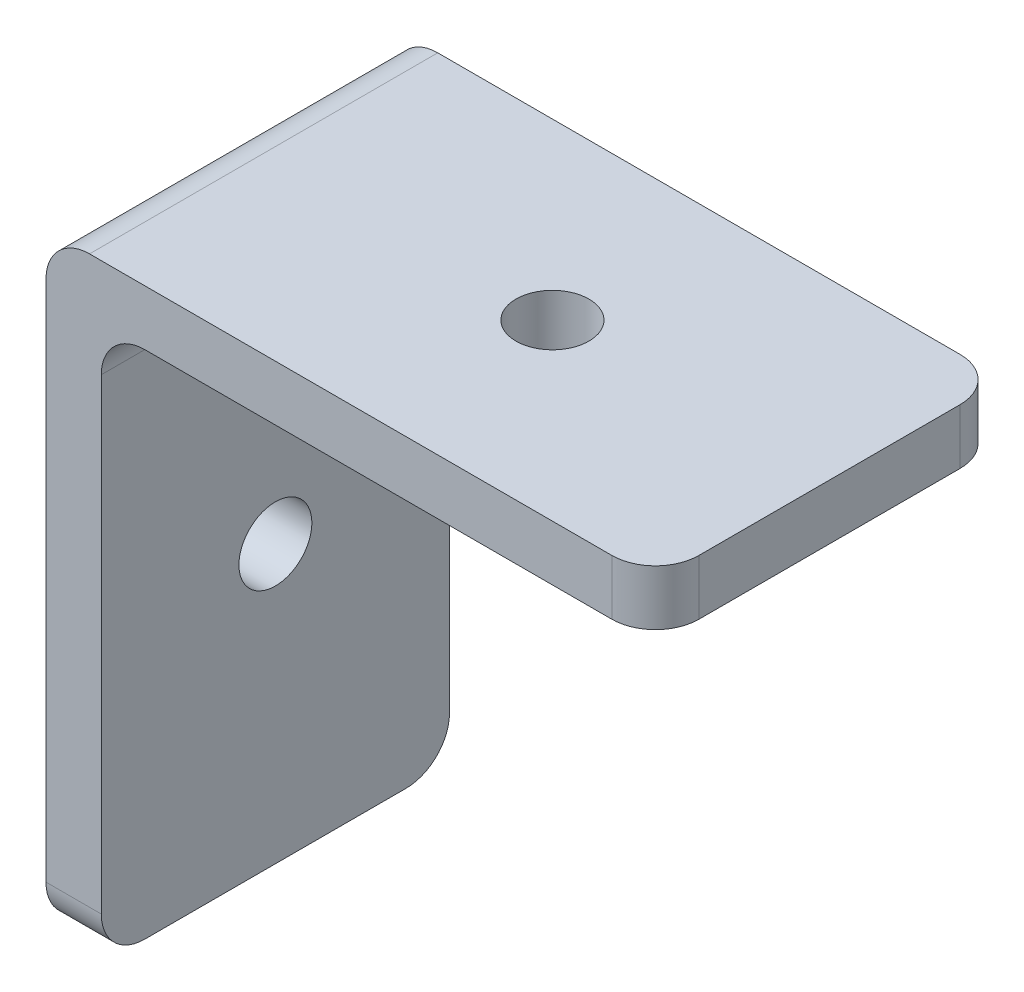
ISO-10303-21;
HEADER;
FILE_DESCRIPTION(('STEP AP214'),'2;1');
FILE_NAME('part.step','',(''),(''),'','','');
FILE_SCHEMA(('AUTOMOTIVE_DESIGN { 1 0 10303 214 1 1 1 1 }'));
ENDSEC;
DATA;
#1=APPLICATION_CONTEXT('core data for automotive mechanical design processes');
#2=APPLICATION_PROTOCOL_DEFINITION('international standard','automotive_design',2000,#1);
#3=PRODUCT_CONTEXT('',#1,'mechanical');
#4=PRODUCT('Part','Part','',(#3));
#5=PRODUCT_RELATED_PRODUCT_CATEGORY('part','',(#4));
#6=PRODUCT_DEFINITION_FORMATION('','',#4);
#7=PRODUCT_DEFINITION_CONTEXT('part definition',#1,'design');
#8=PRODUCT_DEFINITION('design','',#6,#7);
#9=PRODUCT_DEFINITION_SHAPE('','',#8);
#10=(LENGTH_UNIT() NAMED_UNIT(*) SI_UNIT(.MILLI.,.METRE.));
#11=(NAMED_UNIT(*) PLANE_ANGLE_UNIT() SI_UNIT($,.RADIAN.));
#12=(NAMED_UNIT(*) SI_UNIT($,.STERADIAN.) SOLID_ANGLE_UNIT());
#13=UNCERTAINTY_MEASURE_WITH_UNIT(LENGTH_MEASURE(1.E-05),#10,'distance_accuracy_value','');
#14=(GEOMETRIC_REPRESENTATION_CONTEXT(3) GLOBAL_UNCERTAINTY_ASSIGNED_CONTEXT((#13)) GLOBAL_UNIT_ASSIGNED_CONTEXT((#10,
#11,#12)) REPRESENTATION_CONTEXT('',''));
#15=CARTESIAN_POINT('',(0.,0.,0.));
#16=DIRECTION('',(0.,0.,1.));
#17=DIRECTION('',(1.,0.,0.));
#18=AXIS2_PLACEMENT_3D('',#15,#16,#17);
#19=CARTESIAN_POINT('',(0.,0.,0.));
#20=DIRECTION('',(0.,0.,1.));
#21=DIRECTION('',(1.,0.,0.));
#22=AXIS2_PLACEMENT_3D('',#19,#20,#21);
#23=PLANE('',#22);
#24=DIRECTION('',(0.,-1.,0.));
#25=VECTOR('',#24,1.);
#26=CARTESIAN_POINT('',(9.99999999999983,0.,0.));
#27=LINE('',#26,#25);
#28=CARTESIAN_POINT('',(9.99999999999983,212.5,0.));
#29=VERTEX_POINT('',#28);
#30=CARTESIAN_POINT('',(9.99999999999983,182.5,0.));
#31=VERTEX_POINT('',#30);
#32=EDGE_CURVE('E235',#29,#31,#27,.T.);
#33=ORIENTED_EDGE('',*,*,#32,.T.);
#34=DIRECTION('',(-1.,0.,0.));
#35=VECTOR('',#34,1.);
#36=CARTESIAN_POINT('',(13.1749999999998,182.5,0.));
#37=LINE('',#36,#35);
#38=CARTESIAN_POINT('',(13.1749999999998,182.5,0.));
#39=VERTEX_POINT('',#38);
#40=EDGE_CURVE('E182',#31,#39,#37,.F.);
#41=ORIENTED_EDGE('',*,*,#40,.T.);
#42=DIRECTION('',(0.,-1.,0.));
#43=VECTOR('',#42,1.);
#44=CARTESIAN_POINT('',(13.1749999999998,0.,0.));
#45=LINE('',#44,#43);
#46=CARTESIAN_POINT('',(13.1749999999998,209.325,0.));
#47=VERTEX_POINT('',#46);
#48=EDGE_CURVE('E206',#47,#39,#45,.T.);
#49=ORIENTED_EDGE('',*,*,#48,.F.);
#50=CARTESIAN_POINT('',(15.6749999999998,209.325,0.));
#51=DIRECTION('',(0.,0.,1.));
#52=DIRECTION('',(1.,0.,0.));
#53=AXIS2_PLACEMENT_3D('',#50,#51,#52);
#54=CIRCLE('',#53,2.5);
#55=CARTESIAN_POINT('',(15.6749999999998,211.825,0.));
#56=VERTEX_POINT('',#55);
#57=EDGE_CURVE('E49',#47,#56,#54,.F.);
#58=ORIENTED_EDGE('',*,*,#57,.T.);
#59=DIRECTION('',(-1.,0.,0.));
#60=VECTOR('',#59,1.);
#61=CARTESIAN_POINT('',(0.,211.825,0.));
#62=LINE('',#61,#60);
#63=CARTESIAN_POINT('',(42.4999999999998,211.825,0.));
#64=VERTEX_POINT('',#63);
#65=EDGE_CURVE('E203',#64,#56,#62,.T.);
#66=ORIENTED_EDGE('',*,*,#65,.F.);
#67=DIRECTION('',(0.,1.,0.));
#68=VECTOR('',#67,1.);
#69=CARTESIAN_POINT('',(42.4999999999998,0.,0.));
#70=LINE('',#69,#68);
#71=CARTESIAN_POINT('',(42.4999999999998,215.,0.));
#72=VERTEX_POINT('',#71);
#73=EDGE_CURVE('E179',#64,#72,#70,.T.);
#74=ORIENTED_EDGE('',*,*,#73,.T.);
#75=DIRECTION('',(-1.,0.,0.));
#76=VECTOR('',#75,1.);
#77=CARTESIAN_POINT('',(0.,215.,0.));
#78=LINE('',#77,#76);
#79=CARTESIAN_POINT('',(12.4999999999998,215.,0.));
#80=VERTEX_POINT('',#79);
#81=EDGE_CURVE('E216',#72,#80,#78,.T.);
#82=ORIENTED_EDGE('',*,*,#81,.T.);
#83=CARTESIAN_POINT('',(12.4999999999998,212.5,0.));
#84=DIRECTION('',(0.,0.,1.));
#85=DIRECTION('',(1.,0.,0.));
#86=AXIS2_PLACEMENT_3D('',#83,#84,#85);
#87=CIRCLE('',#86,2.5);
#88=EDGE_CURVE('E140',#80,#29,#87,.T.);
#89=ORIENTED_EDGE('',*,*,#88,.T.);
#90=EDGE_LOOP('',(#33,#41,#49,#58,#66,#74,#82,#89));
#91=FACE_BOUND('',#90,.T.);
#92=ADVANCED_FACE('F41',(#91),#23,.T.);
#93=CARTESIAN_POINT('',(0.,211.825,-69.4974746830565));
#94=DIRECTION('',(0.,1.,0.));
#95=DIRECTION('',(0.,0.,1.));
#96=AXIS2_PLACEMENT_3D('',#93,#94,#95);
#97=PLANE('',#96);
#98=CARTESIAN_POINT('',(29.0874999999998,211.825,-9.9999999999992));
#99=DIRECTION('',(0.,1.,0.));
#100=DIRECTION('',(-1.,0.,0.));
#101=AXIS2_PLACEMENT_3D('',#98,#99,#100);
#102=CIRCLE('',#101,2.09500000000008);
#103=CARTESIAN_POINT('',(26.9924999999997,211.825,-9.9999999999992));
#104=VERTEX_POINT('',#103);
#105=EDGE_CURVE('E250',#104,#104,#102,.T.);
#106=ORIENTED_EDGE('',*,*,#105,.T.);
#107=EDGE_LOOP('',(#106));
#108=FACE_BOUND('',#107,.T.);
#109=DIRECTION('',(1.,0.,0.));
#110=VECTOR('',#109,1.);
#111=CARTESIAN_POINT('',(-6.79627503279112E-13,211.825,-19.9999999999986));
#112=LINE('',#111,#110);
#113=CARTESIAN_POINT('',(15.6749999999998,211.825,-19.9999999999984));
#114=VERTEX_POINT('',#113);
#115=CARTESIAN_POINT('',(42.4999999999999,211.825,-19.999999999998));
#116=VERTEX_POINT('',#115);
#117=EDGE_CURVE('E223',#114,#116,#112,.T.);
#118=ORIENTED_EDGE('',*,*,#117,.T.);
#119=CARTESIAN_POINT('',(42.4999999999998,211.825,-17.499999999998));
#120=DIRECTION('',(0.,1.,0.));
#121=DIRECTION('',(0.,0.,1.));
#122=AXIS2_PLACEMENT_3D('',#119,#120,#121);
#123=CIRCLE('',#122,2.5);
#124=CARTESIAN_POINT('',(44.9999999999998,211.825,-17.499999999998));
#125=VERTEX_POINT('',#124);
#126=EDGE_CURVE('E188',#116,#125,#123,.F.);
#127=ORIENTED_EDGE('',*,*,#126,.T.);
#128=DIRECTION('',(0.,0.,1.));
#129=VECTOR('',#128,1.);
#130=CARTESIAN_POINT('',(44.9999999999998,211.825,-69.4974746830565));
#131=LINE('',#130,#129);
#132=CARTESIAN_POINT('',(44.9999999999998,211.825,-2.5));
#133=VERTEX_POINT('',#132);
#134=EDGE_CURVE('E237',#125,#133,#131,.T.);
#135=ORIENTED_EDGE('',*,*,#134,.T.);
#136=CARTESIAN_POINT('',(42.4999999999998,211.825,-2.5));
#137=DIRECTION('',(0.,1.,0.));
#138=DIRECTION('',(0.,0.,1.));
#139=AXIS2_PLACEMENT_3D('',#136,#137,#138);
#140=CIRCLE('',#139,2.5);
#141=EDGE_CURVE('E186',#133,#64,#140,.F.);
#142=ORIENTED_EDGE('',*,*,#141,.T.);
#143=ORIENTED_EDGE('',*,*,#65,.T.);
#144=DIRECTION('',(0.,0.,1.));
#145=VECTOR('',#144,1.);
#146=CARTESIAN_POINT('',(15.6749999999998,211.825,-19.9999999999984));
#147=LINE('',#146,#145);
#148=EDGE_CURVE('E184',#56,#114,#147,.F.);
#149=ORIENTED_EDGE('',*,*,#148,.T.);
#150=EDGE_LOOP('',(#118,#127,#135,#142,#143,#149));
#151=FACE_BOUND('',#150,.T.);
#152=ADVANCED_FACE('F212',(#108,#151),#97,.F.);
#153=CARTESIAN_POINT('',(44.9999999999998,0.,-69.4974746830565));
#154=DIRECTION('',(1.,0.,0.));
#155=DIRECTION('',(0.,0.,-1.));
#156=AXIS2_PLACEMENT_3D('',#153,#154,#155);
#157=PLANE('',#156);
#158=ORIENTED_EDGE('',*,*,#134,.F.);
#159=DIRECTION('',(0.,-1.,0.));
#160=VECTOR('',#159,1.);
#161=CARTESIAN_POINT('',(44.9999999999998,215.,-17.499999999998));
#162=LINE('',#161,#160);
#163=CARTESIAN_POINT('',(44.9999999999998,215.,-17.499999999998));
#164=VERTEX_POINT('',#163);
#165=EDGE_CURVE('E63',#125,#164,#162,.F.);
#166=ORIENTED_EDGE('',*,*,#165,.T.);
#167=DIRECTION('',(0.,0.,1.));
#168=VECTOR('',#167,1.);
#169=CARTESIAN_POINT('',(44.9999999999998,215.,-69.4974746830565));
#170=LINE('',#169,#168);
#171=CARTESIAN_POINT('',(44.9999999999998,215.,-2.5));
#172=VERTEX_POINT('',#171);
#173=EDGE_CURVE('E153',#164,#172,#170,.T.);
#174=ORIENTED_EDGE('',*,*,#173,.T.);
#175=DIRECTION('',(0.,1.,0.));
#176=VECTOR('',#175,1.);
#177=CARTESIAN_POINT('',(44.9999999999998,0.,-2.5));
#178=LINE('',#177,#176);
#179=EDGE_CURVE('E190',#172,#133,#178,.F.);
#180=ORIENTED_EDGE('',*,*,#179,.T.);
#181=EDGE_LOOP('',(#158,#166,#174,#180));
#182=FACE_BOUND('',#181,.T.);
#183=ADVANCED_FACE('F261',(#182),#157,.T.);
#184=CARTESIAN_POINT('',(0.,215.,-69.4974746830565));
#185=DIRECTION('',(0.,1.,0.));
#186=DIRECTION('',(0.,0.,1.));
#187=AXIS2_PLACEMENT_3D('',#184,#185,#186);
#188=PLANE('',#187);
#189=CARTESIAN_POINT('',(29.0874999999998,215.,-9.9999999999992));
#190=DIRECTION('',(0.,1.,0.));
#191=DIRECTION('',(-1.,0.,0.));
#192=AXIS2_PLACEMENT_3D('',#189,#190,#191);
#193=CIRCLE('',#192,2.09500000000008);
#194=CARTESIAN_POINT('',(26.9924999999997,215.,-9.9999999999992));
#195=VERTEX_POINT('',#194);
#196=EDGE_CURVE('E247',#195,#195,#193,.T.);
#197=ORIENTED_EDGE('',*,*,#196,.F.);
#198=EDGE_LOOP('',(#197));
#199=FACE_BOUND('',#198,.T.);
#200=ORIENTED_EDGE('',*,*,#173,.F.);
#201=CARTESIAN_POINT('',(42.4999999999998,215.,-17.499999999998));
#202=DIRECTION('',(0.,1.,0.));
#203=DIRECTION('',(0.,0.,1.));
#204=AXIS2_PLACEMENT_3D('',#201,#202,#203);
#205=CIRCLE('',#204,2.5);
#206=CARTESIAN_POINT('',(42.4999999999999,215.,-19.999999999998));
#207=VERTEX_POINT('',#206);
#208=EDGE_CURVE('E197',#164,#207,#205,.T.);
#209=ORIENTED_EDGE('',*,*,#208,.T.);
#210=DIRECTION('',(1.,0.,0.));
#211=VECTOR('',#210,1.);
#212=CARTESIAN_POINT('',(-6.79627503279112E-13,215.,-19.9999999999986));
#213=LINE('',#212,#211);
#214=CARTESIAN_POINT('',(12.4999999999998,215.,-19.9999999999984));
#215=VERTEX_POINT('',#214);
#216=EDGE_CURVE('E227',#215,#207,#213,.T.);
#217=ORIENTED_EDGE('',*,*,#216,.F.);
#218=DIRECTION('',(0.,0.,1.));
#219=VECTOR('',#218,1.);
#220=CARTESIAN_POINT('',(12.4999999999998,215.,-69.4974746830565));
#221=LINE('',#220,#219);
#222=EDGE_CURVE('E193',#215,#80,#221,.T.);
#223=ORIENTED_EDGE('',*,*,#222,.T.);
#224=ORIENTED_EDGE('',*,*,#81,.F.);
#225=CARTESIAN_POINT('',(42.4999999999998,215.,-2.5));
#226=DIRECTION('',(0.,1.,0.));
#227=DIRECTION('',(0.,0.,1.));
#228=AXIS2_PLACEMENT_3D('',#225,#226,#227);
#229=CIRCLE('',#228,2.5);
#230=EDGE_CURVE('E56',#72,#172,#229,.T.);
#231=ORIENTED_EDGE('',*,*,#230,.T.);
#232=EDGE_LOOP('',(#200,#209,#217,#223,#224,#231));
#233=FACE_BOUND('',#232,.T.);
#234=ADVANCED_FACE('F259',(#199,#233),#188,.T.);
#235=CARTESIAN_POINT('',(9.99999999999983,0.,-69.4974746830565));
#236=DIRECTION('',(-1.,0.,0.));
#237=DIRECTION('',(0.,0.,1.));
#238=AXIS2_PLACEMENT_3D('',#235,#236,#237);
#239=PLANE('',#238);
#240=CARTESIAN_POINT('',(9.99999999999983,195.9125,-9.9999999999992));
#241=DIRECTION('',(1.,0.,0.));
#242=DIRECTION('',(0.,1.,0.));
#243=AXIS2_PLACEMENT_3D('',#240,#241,#242);
#244=CIRCLE('',#243,2.09500000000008);
#245=CARTESIAN_POINT('',(9.99999999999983,198.0075,-9.9999999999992));
#246=VERTEX_POINT('',#245);
#247=EDGE_CURVE('E231',#246,#246,#244,.T.);
#248=ORIENTED_EDGE('',*,*,#247,.T.);
#249=EDGE_LOOP('',(#248));
#250=FACE_BOUND('',#249,.T.);
#251=DIRECTION('',(0.,1.,0.));
#252=VECTOR('',#251,1.);
#253=CARTESIAN_POINT('',(9.99999999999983,1.61168975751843E-13,-19.9999999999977));
#254=LINE('',#253,#252);
#255=CARTESIAN_POINT('',(9.99999999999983,182.5,-19.9999999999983));
#256=VERTEX_POINT('',#255);
#257=CARTESIAN_POINT('',(9.99999999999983,212.5,-19.9999999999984));
#258=VERTEX_POINT('',#257);
#259=EDGE_CURVE('E136',#256,#258,#254,.T.);
#260=ORIENTED_EDGE('',*,*,#259,.F.);
#261=CARTESIAN_POINT('',(9.99999999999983,182.5,-17.4999999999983));
#262=DIRECTION('',(-1.,0.,0.));
#263=DIRECTION('',(0.,0.,1.));
#264=AXIS2_PLACEMENT_3D('',#261,#262,#263);
#265=CIRCLE('',#264,2.5);
#266=CARTESIAN_POINT('',(9.99999999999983,180.,-17.4999999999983));
#267=VERTEX_POINT('',#266);
#268=EDGE_CURVE('E131',#256,#267,#265,.T.);
#269=ORIENTED_EDGE('',*,*,#268,.T.);
#270=DIRECTION('',(0.,0.,1.));
#271=VECTOR('',#270,1.);
#272=CARTESIAN_POINT('',(9.99999999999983,180.,-69.4974746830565));
#273=LINE('',#272,#271);
#274=CARTESIAN_POINT('',(9.99999999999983,180.,-2.5));
#275=VERTEX_POINT('',#274);
#276=EDGE_CURVE('E134',#267,#275,#273,.T.);
#277=ORIENTED_EDGE('',*,*,#276,.T.);
#278=CARTESIAN_POINT('',(9.99999999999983,182.5,-2.5));
#279=DIRECTION('',(-1.,0.,0.));
#280=DIRECTION('',(0.,0.,1.));
#281=AXIS2_PLACEMENT_3D('',#278,#279,#280);
#282=CIRCLE('',#281,2.5);
#283=EDGE_CURVE('E141',#275,#31,#282,.T.);
#284=ORIENTED_EDGE('',*,*,#283,.T.);
#285=ORIENTED_EDGE('',*,*,#32,.F.);
#286=DIRECTION('',(0.,0.,1.));
#287=VECTOR('',#286,1.);
#288=CARTESIAN_POINT('',(9.99999999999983,212.5,-69.4974746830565));
#289=LINE('',#288,#287);
#290=EDGE_CURVE('E175',#29,#258,#289,.F.);
#291=ORIENTED_EDGE('',*,*,#290,.T.);
#292=EDGE_LOOP('',(#260,#269,#277,#284,#285,#291));
#293=FACE_BOUND('',#292,.T.);
#294=ADVANCED_FACE('F133',(#250,#293),#239,.T.);
#295=CARTESIAN_POINT('',(0.,180.,-69.4974746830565));
#296=DIRECTION('',(0.,1.,0.));
#297=DIRECTION('',(0.,0.,1.));
#298=AXIS2_PLACEMENT_3D('',#295,#296,#297);
#299=PLANE('',#298);
#300=ORIENTED_EDGE('',*,*,#276,.F.);
#301=DIRECTION('',(1.,0.,0.));
#302=VECTOR('',#301,1.);
#303=CARTESIAN_POINT('',(-7.13953875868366E-13,180.,-17.4999999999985));
#304=LINE('',#303,#302);
#305=CARTESIAN_POINT('',(13.1749999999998,180.,-17.4999999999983));
#306=VERTEX_POINT('',#305);
#307=EDGE_CURVE('E148',#267,#306,#304,.T.);
#308=ORIENTED_EDGE('',*,*,#307,.T.);
#309=DIRECTION('',(0.,0.,1.));
#310=VECTOR('',#309,1.);
#311=CARTESIAN_POINT('',(13.1749999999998,180.,-69.4974746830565));
#312=LINE('',#311,#310);
#313=CARTESIAN_POINT('',(13.1749999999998,180.,-2.5));
#314=VERTEX_POINT('',#313);
#315=EDGE_CURVE('E152',#306,#314,#312,.T.);
#316=ORIENTED_EDGE('',*,*,#315,.T.);
#317=DIRECTION('',(-1.,0.,0.));
#318=VECTOR('',#317,1.);
#319=CARTESIAN_POINT('',(9.99999999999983,180.,-2.5));
#320=LINE('',#319,#318);
#321=EDGE_CURVE('E151',#314,#275,#320,.T.);
#322=ORIENTED_EDGE('',*,*,#321,.T.);
#323=EDGE_LOOP('',(#300,#308,#316,#322));
#324=FACE_BOUND('',#323,.T.);
#325=ADVANCED_FACE('F146',(#324),#299,.F.);
#326=CARTESIAN_POINT('',(13.1749999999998,0.,-69.4974746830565));
#327=DIRECTION('',(-1.,0.,0.));
#328=DIRECTION('',(0.,0.,1.));
#329=AXIS2_PLACEMENT_3D('',#326,#327,#328);
#330=PLANE('',#329);
#331=CARTESIAN_POINT('',(13.1749999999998,195.9125,-9.9999999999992));
#332=DIRECTION('',(1.,0.,0.));
#333=DIRECTION('',(0.,1.,0.));
#334=AXIS2_PLACEMENT_3D('',#331,#332,#333);
#335=CIRCLE('',#334,2.09500000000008);
#336=CARTESIAN_POINT('',(13.1749999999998,198.0075,-9.9999999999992));
#337=VERTEX_POINT('',#336);
#338=EDGE_CURVE('E244',#337,#337,#335,.T.);
#339=ORIENTED_EDGE('',*,*,#338,.F.);
#340=EDGE_LOOP('',(#339));
#341=FACE_BOUND('',#340,.T.);
#342=ORIENTED_EDGE('',*,*,#315,.F.);
#343=CARTESIAN_POINT('',(13.1749999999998,182.5,-17.4999999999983));
#344=DIRECTION('',(-1.,0.,0.));
#345=DIRECTION('',(0.,0.,1.));
#346=AXIS2_PLACEMENT_3D('',#343,#344,#345);
#347=CIRCLE('',#346,2.5);
#348=CARTESIAN_POINT('',(13.1749999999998,182.5,-19.9999999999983));
#349=VERTEX_POINT('',#348);
#350=EDGE_CURVE('E156',#306,#349,#347,.F.);
#351=ORIENTED_EDGE('',*,*,#350,.T.);
#352=DIRECTION('',(0.,1.,0.));
#353=VECTOR('',#352,1.);
#354=CARTESIAN_POINT('',(13.1749999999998,1.61168975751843E-13,-19.9999999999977));
#355=LINE('',#354,#353);
#356=CARTESIAN_POINT('',(13.1749999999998,209.325,-19.9999999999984));
#357=VERTEX_POINT('',#356);
#358=EDGE_CURVE('E162',#349,#357,#355,.T.);
#359=ORIENTED_EDGE('',*,*,#358,.T.);
#360=DIRECTION('',(0.,0.,1.));
#361=VECTOR('',#360,1.);
#362=CARTESIAN_POINT('',(13.1749999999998,209.325,0.));
#363=LINE('',#362,#361);
#364=EDGE_CURVE('E157',#357,#47,#363,.T.);
#365=ORIENTED_EDGE('',*,*,#364,.T.);
#366=ORIENTED_EDGE('',*,*,#48,.T.);
#367=CARTESIAN_POINT('',(13.1749999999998,182.5,-2.5));
#368=DIRECTION('',(-1.,0.,0.));
#369=DIRECTION('',(0.,0.,1.));
#370=AXIS2_PLACEMENT_3D('',#367,#368,#369);
#371=CIRCLE('',#370,2.5);
#372=EDGE_CURVE('E160',#39,#314,#371,.F.);
#373=ORIENTED_EDGE('',*,*,#372,.T.);
#374=EDGE_LOOP('',(#342,#351,#359,#365,#366,#373));
#375=FACE_BOUND('',#374,.T.);
#376=ADVANCED_FACE('F225',(#341,#375),#330,.F.);
#377=CARTESIAN_POINT('',(0.,215.,-19.9999999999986));
#378=DIRECTION('',(0.,0.,1.));
#379=DIRECTION('',(1.,0.,0.));
#380=AXIS2_PLACEMENT_3D('',#377,#378,#379);
#381=PLANE('',#380);
#382=ORIENTED_EDGE('',*,*,#358,.F.);
#383=DIRECTION('',(1.,0.,0.));
#384=VECTOR('',#383,1.);
#385=CARTESIAN_POINT('',(0.,182.5,-19.9999999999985));
#386=LINE('',#385,#384);
#387=EDGE_CURVE('E173',#349,#256,#386,.F.);
#388=ORIENTED_EDGE('',*,*,#387,.T.);
#389=ORIENTED_EDGE('',*,*,#259,.T.);
#390=CARTESIAN_POINT('',(12.4999999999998,212.5,-19.9999999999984));
#391=DIRECTION('',(0.,0.,1.));
#392=DIRECTION('',(1.,0.,0.));
#393=AXIS2_PLACEMENT_3D('',#390,#391,#392);
#394=CIRCLE('',#393,2.5);
#395=EDGE_CURVE('E168',#258,#215,#394,.F.);
#396=ORIENTED_EDGE('',*,*,#395,.T.);
#397=ORIENTED_EDGE('',*,*,#216,.T.);
#398=DIRECTION('',(0.,-1.,0.));
#399=VECTOR('',#398,1.);
#400=CARTESIAN_POINT('',(42.4999999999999,211.825,-19.999999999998));
#401=LINE('',#400,#399);
#402=EDGE_CURVE('E170',#207,#116,#401,.T.);
#403=ORIENTED_EDGE('',*,*,#402,.T.);
#404=ORIENTED_EDGE('',*,*,#117,.F.);
#405=CARTESIAN_POINT('',(15.6749999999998,209.325,-19.9999999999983));
#406=DIRECTION('',(0.,0.,1.));
#407=DIRECTION('',(1.,0.,0.));
#408=AXIS2_PLACEMENT_3D('',#405,#406,#407);
#409=CIRCLE('',#408,2.5);
#410=EDGE_CURVE('E11',#114,#357,#409,.T.);
#411=ORIENTED_EDGE('',*,*,#410,.T.);
#412=EDGE_LOOP('',(#382,#388,#389,#396,#397,#403,#404,#411));
#413=FACE_BOUND('',#412,.T.);
#414=ADVANCED_FACE('F222',(#413),#381,.F.);
#415=CARTESIAN_POINT('',(9.99999999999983,195.9125,-9.9999999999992));
#416=DIRECTION('',(1.,0.,0.));
#417=DIRECTION('',(0.,1.,0.));
#418=AXIS2_PLACEMENT_3D('',#415,#416,#417);
#419=CYLINDRICAL_SURFACE('',#418,2.09500000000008);
#420=ORIENTED_EDGE('',*,*,#247,.F.);
#421=EDGE_LOOP('',(#420));
#422=FACE_BOUND('',#421,.T.);
#423=ORIENTED_EDGE('',*,*,#338,.T.);
#424=EDGE_LOOP('',(#423));
#425=FACE_BOUND('',#424,.T.);
#426=ADVANCED_FACE('F286',(#422,#425),#419,.F.);
#427=CARTESIAN_POINT('',(-7.13953875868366E-13,182.5,-17.4999999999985));
#428=DIRECTION('',(1.,0.,0.));
#429=DIRECTION('',(0.,0.,-1.));
#430=AXIS2_PLACEMENT_3D('',#427,#428,#429);
#431=CYLINDRICAL_SURFACE('',#430,2.5);
#432=ORIENTED_EDGE('',*,*,#268,.F.);
#433=ORIENTED_EDGE('',*,*,#387,.F.);
#434=ORIENTED_EDGE('',*,*,#350,.F.);
#435=ORIENTED_EDGE('',*,*,#307,.F.);
#436=EDGE_LOOP('',(#432,#433,#434,#435));
#437=FACE_BOUND('',#436,.T.);
#438=ADVANCED_FACE('F155',(#437),#431,.T.);
#439=CARTESIAN_POINT('',(0.,182.5,-2.5));
#440=DIRECTION('',(1.,0.,0.));
#441=DIRECTION('',(0.,0.,-1.));
#442=AXIS2_PLACEMENT_3D('',#439,#440,#441);
#443=CYLINDRICAL_SURFACE('',#442,2.5);
#444=ORIENTED_EDGE('',*,*,#372,.F.);
#445=ORIENTED_EDGE('',*,*,#40,.F.);
#446=ORIENTED_EDGE('',*,*,#283,.F.);
#447=ORIENTED_EDGE('',*,*,#321,.F.);
#448=EDGE_LOOP('',(#444,#445,#446,#447));
#449=FACE_BOUND('',#448,.T.);
#450=ADVANCED_FACE('F278',(#449),#443,.T.);
#451=CARTESIAN_POINT('',(42.4999999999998,215.,-17.499999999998));
#452=DIRECTION('',(0.,1.,0.));
#453=DIRECTION('',(0.,0.,1.));
#454=AXIS2_PLACEMENT_3D('',#451,#452,#453);
#455=CYLINDRICAL_SURFACE('',#454,2.5);
#456=ORIENTED_EDGE('',*,*,#208,.F.);
#457=ORIENTED_EDGE('',*,*,#165,.F.);
#458=ORIENTED_EDGE('',*,*,#126,.F.);
#459=ORIENTED_EDGE('',*,*,#402,.F.);
#460=EDGE_LOOP('',(#456,#457,#458,#459));
#461=FACE_BOUND('',#460,.T.);
#462=ADVANCED_FACE('F266',(#461),#455,.T.);
#463=CARTESIAN_POINT('',(42.4999999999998,0.,-2.5));
#464=DIRECTION('',(0.,1.,0.));
#465=DIRECTION('',(0.,0.,1.));
#466=AXIS2_PLACEMENT_3D('',#463,#464,#465);
#467=CYLINDRICAL_SURFACE('',#466,2.5);
#468=ORIENTED_EDGE('',*,*,#141,.F.);
#469=ORIENTED_EDGE('',*,*,#179,.F.);
#470=ORIENTED_EDGE('',*,*,#230,.F.);
#471=ORIENTED_EDGE('',*,*,#73,.F.);
#472=EDGE_LOOP('',(#468,#469,#470,#471));
#473=FACE_BOUND('',#472,.T.);
#474=ADVANCED_FACE('F268',(#473),#467,.T.);
#475=CARTESIAN_POINT('',(12.4999999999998,212.5,-69.4974746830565));
#476=DIRECTION('',(0.,0.,1.));
#477=DIRECTION('',(1.,0.,0.));
#478=AXIS2_PLACEMENT_3D('',#475,#476,#477);
#479=CYLINDRICAL_SURFACE('',#478,2.5);
#480=ORIENTED_EDGE('',*,*,#395,.F.);
#481=ORIENTED_EDGE('',*,*,#290,.F.);
#482=ORIENTED_EDGE('',*,*,#88,.F.);
#483=ORIENTED_EDGE('',*,*,#222,.F.);
#484=EDGE_LOOP('',(#480,#481,#482,#483));
#485=FACE_BOUND('',#484,.T.);
#486=ADVANCED_FACE('F272',(#485),#479,.T.);
#487=CARTESIAN_POINT('',(15.6749999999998,209.325,-69.4974746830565));
#488=DIRECTION('',(0.,0.,-1.));
#489=DIRECTION('',(-1.,0.,0.));
#490=AXIS2_PLACEMENT_3D('',#487,#488,#489);
#491=CYLINDRICAL_SURFACE('',#490,2.5);
#492=ORIENTED_EDGE('',*,*,#410,.F.);
#493=ORIENTED_EDGE('',*,*,#148,.F.);
#494=ORIENTED_EDGE('',*,*,#57,.F.);
#495=ORIENTED_EDGE('',*,*,#364,.F.);
#496=EDGE_LOOP('',(#492,#493,#494,#495));
#497=FACE_BOUND('',#496,.T.);
#498=ADVANCED_FACE('F43',(#497),#491,.F.);
#499=CARTESIAN_POINT('',(29.0874999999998,215.,-9.9999999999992));
#500=DIRECTION('',(0.,-1.,0.));
#501=DIRECTION('',(1.,0.,0.));
#502=AXIS2_PLACEMENT_3D('',#499,#500,#501);
#503=CYLINDRICAL_SURFACE('',#502,2.09500000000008);
#504=ORIENTED_EDGE('',*,*,#196,.T.);
#505=EDGE_LOOP('',(#504));
#506=FACE_BOUND('',#505,.T.);
#507=ORIENTED_EDGE('',*,*,#105,.F.);
#508=EDGE_LOOP('',(#507));
#509=FACE_BOUND('',#508,.T.);
#510=ADVANCED_FACE('F256',(#506,#509),#503,.F.);
#511=CLOSED_SHELL('',(#92,#152,#183,#234,#294,#325,#376,#414,#426,#438,#450,#462,#474,#486,#498,#510));
#512=MANIFOLD_SOLID_BREP('B2',#511);
#513=ADVANCED_BREP_SHAPE_REPRESENTATION('',(#18,#512),#14);
#514=SHAPE_DEFINITION_REPRESENTATION(#9,#513);
ENDSEC;
END-ISO-10303-21;
